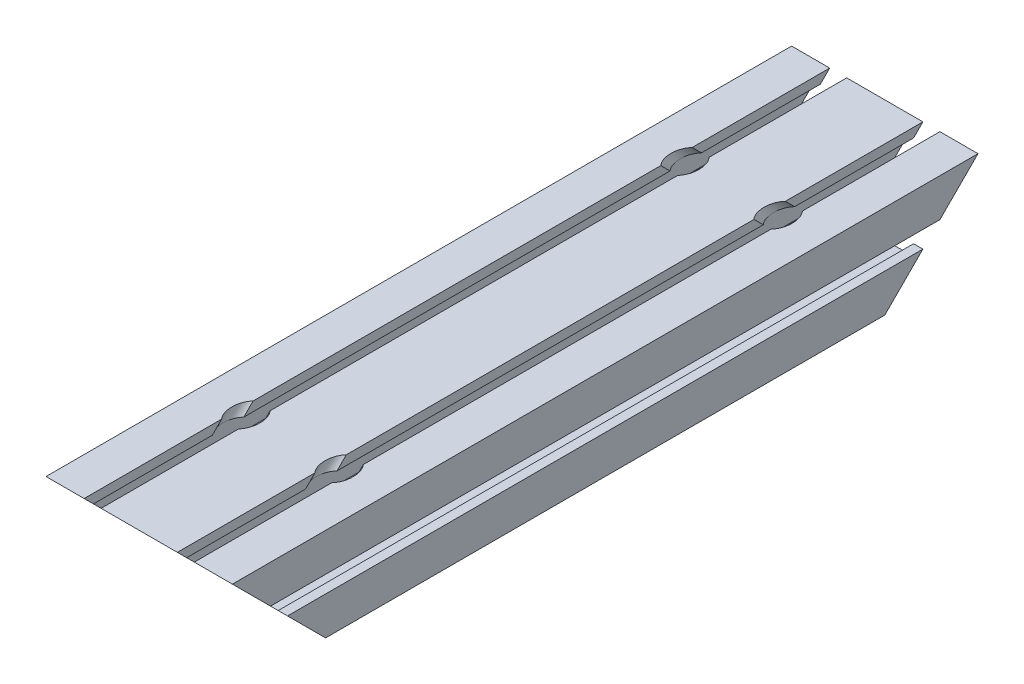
from build123d import *

# Parameters (mm, degrees)
EXTRUDE1_DEPTH      = 180
EXTRUDE1_DEPTH_BACK = 180
SKETCH1_R           = 5.85
EXTRUDE2_DEPTH      = 203.500000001
SKETCH3_R           = 4.25
EXTRUDE3_DEPTH      = 282.474910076
SKETCH4_R           = 6.75
SKETCH4_R_2         = 4.25
EXTRUDE4_DEPTH      = 263.111464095


with BuildPart() as part:
    # Sketch1 → Extrude1 (new, two sides: drawn at the far end of the back side and taken through both)
    with BuildSketch(Plane.XY.offset(-EXTRUDE1_DEPTH_BACK)):
        Polygon((40.499999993, 4.099999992), (44.999999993, 4.099999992), (44.999999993, 22.499999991), (26.599999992, 22.499999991), (26.599999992, 17.999999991), (29.299999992, 17.999999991), (29.299999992, 9.499999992), (26.999999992, 7.199999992), (17.999999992, 7.199999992), (15.699999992, 9.499999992), (15.699999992, 17.999999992), (18.399999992, 17.999999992), (18.399999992, 22.499999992), (-18.400000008, 22.499999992), (-18.400000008, 17.999999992), (-15.700000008, 17.999999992), (-15.700000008, 9.499999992), (-18.000000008, 7.199999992), (-27.000000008, 7.199999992), (-29.300000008, 9.499999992), (-29.300000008, 17.999999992), (-26.600000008, 17.999999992), (-26.600000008, 22.499999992), (-45.000000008, 22.499999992), (-45.000000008, 4.099999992), (-40.500000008, 4.099999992), (-40.500000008, 6.799999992), (-32.000000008, 6.799999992), (-29.700000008, 4.499999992), (-29.700000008, -4.500000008), (-32.000000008, -6.800000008), (-40.500000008, -6.800000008), (-40.500000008, -4.100000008), (-45.000000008, -4.100000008), (-45.000000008, -22.500000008), (-26.600000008, -22.500000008), (-26.600000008, -18.000000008), (-29.300000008, -18.000000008), (-29.300000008, -9.500000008), (-27.000000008, -7.200000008), (-18.000000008, -7.200000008), (-15.700000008, -9.500000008), (-15.700000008, -18.000000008), (-18.400000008, -18.000000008), (-18.400000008, -22.500000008), (18.399999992, -22.500000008), (18.399999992, -18.000000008), (15.699999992, -18.000000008), (15.699999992, -9.500000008), (17.999999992, -7.200000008), (26.999999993, -7.200000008), (29.299999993, -9.500000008), (29.299999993, -18.000000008), (26.599999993, -18.000000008), (26.599999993, -22.500000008), (44.999999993, -22.500000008), (44.999999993, -4.100000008), (40.499999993, -4.100000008), (40.499999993, -6.800000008), (31.999999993, -6.800000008), (29.699999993, -4.500000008), (29.699999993, 4.499999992), (31.999999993, 6.799999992), (40.499999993, 6.799999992), align=None)
        with Locations((37.149999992, 14.649999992)):
            Circle(SKETCH1_R, mode=Mode.SUBTRACT)
        with Locations((37.149999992, -14.650000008)):
            Circle(SKETCH1_R, mode=Mode.SUBTRACT)
        with Locations((-37.150000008, -14.650000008)):
            Circle(SKETCH1_R, mode=Mode.SUBTRACT)
        with Locations((-37.150000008, 14.649999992)):
            Circle(SKETCH1_R, mode=Mode.SUBTRACT)
        with BuildLine():
            Line((12.499999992, -19.500000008), (-12.500000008, -19.500000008))
            ThreePointArc((-12.500000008, -19.500000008), (-13.207106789, -19.20710679), (-13.500000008, -18.500000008))
            Line((-13.500000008, -18.500000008), (-13.500000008, 18.499999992))
            ThreePointArc((-13.500000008, 18.499999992), (-13.207106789, 19.207106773), (-12.500000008, 19.499999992))
            Line((-12.500000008, 19.499999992), (12.499999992, 19.499999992))
            ThreePointArc((12.499999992, 19.499999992), (13.207106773, 19.207106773), (13.499999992, 18.499999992))
            Line((13.499999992, 18.499999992), (13.499999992, -18.500000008))
            ThreePointArc((13.499999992, -18.500000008), (13.207106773, -19.20710679), (12.499999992, -19.500000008))
        make_face(mode=Mode.SUBTRACT)
        with BuildLine():
            Line((-27.096194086, -3.181980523), (-25.762737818, -1.848524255))
            ThreePointArc((-25.762737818, -1.848524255), (-26.249999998, -6e-09), (-25.762737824, 1.848524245))
            Line((-25.762737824, 1.848524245), (-27.096194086, 3.181980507))
            Line((-27.096194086, 3.181980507), (-25.681980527, 4.596194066))
            Line((-25.681980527, 4.596194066), (-24.348524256, 3.262737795))
            ThreePointArc((-24.348524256, 3.262737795), (-22.500000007, 3.749999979), (-20.651475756, 3.262737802))
            Line((-20.651475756, 3.262737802), (-19.318019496, 4.596194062))
            Line((-19.318019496, 4.596194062), (-17.903805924, 3.181980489))
            Line((-17.903805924, 3.181980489), (-19.237262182, 1.84852423))
            ThreePointArc((-19.237262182, 1.84852423), (-18.750000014, -1.1e-08), (-19.237262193, -1.848524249))
            Line((-19.237262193, -1.848524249), (-17.903805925, -3.181980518))
            Line((-17.903805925, -3.181980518), (-19.31801949, -4.596194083))
            Line((-19.31801949, -4.596194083), (-20.65147575, -3.262737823))
            ThreePointArc((-20.65147575, -3.262737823), (-22.499999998, -3.750000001), (-24.348524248, -3.262737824))
            Line((-24.348524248, -3.262737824), (-25.681980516, -4.596194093))
            Line((-25.681980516, -4.596194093), (-27.096194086, -3.181980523))
        make_face(mode=Mode.SUBTRACT)
        with BuildLine():
            Line((17.903805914, -3.181980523), (19.237262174, -1.848524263))
            ThreePointArc((19.237262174, -1.848524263), (18.749999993, -8e-09), (19.237262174, 1.848524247))
            Line((19.237262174, 1.848524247), (17.903805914, 3.181980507))
            Line((17.903805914, 3.181980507), (19.318019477, 4.59619407))
            Line((19.318019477, 4.59619407), (20.651475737, 3.26273781))
            ThreePointArc((20.651475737, 3.26273781), (22.499999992, 3.74999999), (24.348524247, 3.262737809))
            Line((24.348524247, 3.262737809), (25.681980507, 4.596194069))
            Line((25.681980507, 4.596194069), (27.09619407, 3.181980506))
            Line((27.09619407, 3.181980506), (25.76273781, 1.848524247))
            ThreePointArc((25.76273781, 1.848524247), (26.249999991, -9e-09), (25.76273781, -1.848524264))
            Line((25.76273781, -1.848524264), (27.09619407, -3.181980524))
            Line((27.09619407, -3.181980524), (25.681980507, -4.596194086))
            Line((25.681980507, -4.596194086), (24.348524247, -3.262737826))
            ThreePointArc((24.348524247, -3.262737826), (22.499999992, -3.750000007), (20.651475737, -3.262737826))
            Line((20.651475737, -3.262737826), (19.318019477, -4.596194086))
            Line((19.318019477, -4.596194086), (17.903805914, -3.181980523))
        make_face(mode=Mode.SUBTRACT)
    extrude(amount=EXTRUDE1_DEPTH + EXTRUDE1_DEPTH_BACK)

    # Sketch2 → Extrude2 (cut, through all)
    with BuildSketch(Plane(origin=(44.999999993, 0, 0), x_dir=(0, 0, -1), z_dir=(1, 0, 0))):
        Polygon((-180, 22.499999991), (-135.000000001, -22.500000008), (-180, -22.500000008), align=None)
        Polygon((180, 22.499999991), (180, -22.500000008), (135.000000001, -22.500000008), align=None)
    extrude(amount=-EXTRUDE2_DEPTH, mode=Mode.SUBTRACT)

    # Sketch3 → Extrude3 (cut, through all)
    with BuildSketch(Plane(origin=(0, -78.750000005, 78.750000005), x_dir=(1, 0, 0), z_dir=(0, -0.7071067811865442, 0.7071067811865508))):
        with Locations(Location((-22.500000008, 90.865123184, 0), (0, 0, 244.218086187))):
            Circle(SKETCH3_R)
        with Locations(Location((22.499999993, 90.865123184, 0), (0, 0, 244.218085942))):
            Circle(SKETCH3_R)
    extrude3 = extrude(amount=-EXTRUDE3_DEPTH, mode=Mode.SUBTRACT)

    # Sketch4 → Extrude4 (cut, through all)
    # profile 1 of 2: a face of its own
    with BuildSketch(Plane(origin=(0, -63.483564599, 63.483564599), x_dir=(1, 0, 0), z_dir=(0, -0.7071067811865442, 0.7071067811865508))):
        with Locations(Location((-22.500000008, 90.865123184, 0), (0, 0, 254.106188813))):
            Circle(SKETCH4_R)
        with Locations(Location((-22.500000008, 90.865123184, 0), (0, 0, 244.218086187))):
            Circle(SKETCH4_R_2, mode=Mode.SUBTRACT)
    # profile 2 of 2: a face of its own
    with BuildSketch(Plane(origin=(0, -63.483564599, 63.483564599), x_dir=(1, 0, 0), z_dir=(0, -0.7071067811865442, 0.7071067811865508))):
        with Locations(Location((22.499999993, 90.865123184, 0), (0, 0, 254.106188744))):
            Circle(SKETCH4_R)
        with Locations(Location((22.499999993, 90.865123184, 0), (0, 0, 244.218085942))):
            Circle(SKETCH4_R_2, mode=Mode.SUBTRACT)
    extrude4 = extrude(amount=-EXTRUDE4_DEPTH, mode=Mode.SUBTRACT)

    # Mirror1: Extrude3, Extrude4 across plane
    add(extrude3.mirror(Plane.XY), mode=Mode.SUBTRACT)
    add(extrude4.mirror(Plane.XY), mode=Mode.SUBTRACT)


solid = part.part
